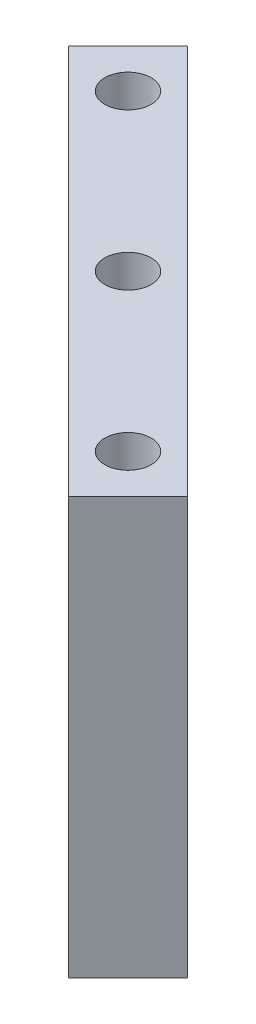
ISO-10303-21;
HEADER;
FILE_DESCRIPTION(('STEP AP214'),'2;1');
FILE_NAME('part.step','',(''),(''),'','','');
FILE_SCHEMA(('AUTOMOTIVE_DESIGN { 1 0 10303 214 1 1 1 1 }'));
ENDSEC;
DATA;
#1=APPLICATION_CONTEXT('core data for automotive mechanical design processes');
#2=APPLICATION_PROTOCOL_DEFINITION('international standard','automotive_design',2000,#1);
#3=PRODUCT_CONTEXT('',#1,'mechanical');
#4=PRODUCT('Part','Part','',(#3));
#5=PRODUCT_RELATED_PRODUCT_CATEGORY('part','',(#4));
#6=PRODUCT_DEFINITION_FORMATION('','',#4);
#7=PRODUCT_DEFINITION_CONTEXT('part definition',#1,'design');
#8=PRODUCT_DEFINITION('design','',#6,#7);
#9=PRODUCT_DEFINITION_SHAPE('','',#8);
#10=(LENGTH_UNIT() NAMED_UNIT(*) SI_UNIT(.MILLI.,.METRE.));
#11=(NAMED_UNIT(*) PLANE_ANGLE_UNIT() SI_UNIT($,.RADIAN.));
#12=(NAMED_UNIT(*) SI_UNIT($,.STERADIAN.) SOLID_ANGLE_UNIT());
#13=UNCERTAINTY_MEASURE_WITH_UNIT(LENGTH_MEASURE(1.E-05),#10,'distance_accuracy_value','');
#14=(GEOMETRIC_REPRESENTATION_CONTEXT(3) GLOBAL_UNCERTAINTY_ASSIGNED_CONTEXT((#13)) GLOBAL_UNIT_ASSIGNED_CONTEXT((#10,
#11,#12)) REPRESENTATION_CONTEXT('',''));
#15=CARTESIAN_POINT('',(0.,0.,0.));
#16=DIRECTION('',(0.,0.,1.));
#17=DIRECTION('',(1.,0.,0.));
#18=AXIS2_PLACEMENT_3D('',#15,#16,#17);
#19=CARTESIAN_POINT('',(0.,37.8,0.));
#20=DIRECTION('',(0.,1.,0.));
#21=DIRECTION('',(0.,0.,1.));
#22=AXIS2_PLACEMENT_3D('',#19,#20,#21);
#23=PLANE('',#22);
#24=CARTESIAN_POINT('',(55.5456351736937,37.8,55.545635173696));
#25=DIRECTION('',(0.,1.,0.));
#26=DIRECTION('',(0.,0.,1.));
#27=AXIS2_PLACEMENT_3D('',#24,#25,#26);
#28=CIRCLE('',#27,2.10000000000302);
#29=CARTESIAN_POINT('',(55.5456351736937,37.8,57.645635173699));
#30=VERTEX_POINT('',#29);
#31=EDGE_CURVE('E123',#30,#30,#28,.T.);
#32=ORIENTED_EDGE('',*,*,#31,.F.);
#33=EDGE_LOOP('',(#32));
#34=FACE_BOUND('',#33,.T.);
#35=DIRECTION('',(0.707106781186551,0.,0.707106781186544));
#36=VECTOR('',#35,1.);
#37=CARTESIAN_POINT('',(35.180959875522,37.8,40.5549714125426));
#38=LINE('',#37,#36);
#39=CARTESIAN_POINT('',(35.180959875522,37.8,40.5549714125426));
#40=VERTEX_POINT('',#39);
#41=CARTESIAN_POINT('',(70.5362989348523,37.8,75.9103104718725));
#42=VERTEX_POINT('',#41);
#43=EDGE_CURVE('E93',#40,#42,#38,.T.);
#44=ORIENTED_EDGE('',*,*,#43,.T.);
#45=DIRECTION('',(0.707106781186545,0.,-0.70710678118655));
#46=VECTOR('',#45,1.);
#47=CARTESIAN_POINT('',(70.5362989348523,37.8,75.9103104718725));
#48=LINE('',#47,#46);
#49=CARTESIAN_POINT('',(75.9103104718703,37.8,70.5362989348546));
#50=VERTEX_POINT('',#49);
#51=EDGE_CURVE('E88',#42,#50,#48,.T.);
#52=ORIENTED_EDGE('',*,*,#51,.T.);
#53=DIRECTION('',(-0.707106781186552,0.,-0.707106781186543));
#54=VECTOR('',#53,1.);
#55=CARTESIAN_POINT('',(40.5549714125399,37.8,35.1809598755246));
#56=LINE('',#55,#54);
#57=CARTESIAN_POINT('',(40.5549714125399,37.8,35.1809598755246));
#58=VERTEX_POINT('',#57);
#59=EDGE_CURVE('E91',#50,#58,#56,.T.);
#60=ORIENTED_EDGE('',*,*,#59,.T.);
#61=DIRECTION('',(-0.707106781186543,0.,0.707106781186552));
#62=VECTOR('',#61,1.);
#63=CARTESIAN_POINT('',(35.180959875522,37.8,40.5549714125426));
#64=LINE('',#63,#62);
#65=EDGE_CURVE('E58',#58,#40,#64,.T.);
#66=ORIENTED_EDGE('',*,*,#65,.T.);
#67=EDGE_LOOP('',(#44,#52,#60,#66));
#68=FACE_BOUND('',#67,.T.);
#69=CARTESIAN_POINT('',(41.4034995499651,37.8,41.4034995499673));
#70=DIRECTION('',(0.,1.,0.));
#71=DIRECTION('',(0.,0.,1.));
#72=AXIS2_PLACEMENT_3D('',#69,#70,#71);
#73=CIRCLE('',#72,2.10000000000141);
#74=CARTESIAN_POINT('',(41.4034995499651,37.8,43.5034995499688));
#75=VERTEX_POINT('',#74);
#76=EDGE_CURVE('E108',#75,#75,#73,.T.);
#77=ORIENTED_EDGE('',*,*,#76,.F.);
#78=EDGE_LOOP('',(#77));
#79=FACE_BOUND('',#78,.T.);
#80=CARTESIAN_POINT('',(69.6877707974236,37.8,69.6877707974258));
#81=DIRECTION('',(0.,1.,0.));
#82=DIRECTION('',(0.,0.,1.));
#83=AXIS2_PLACEMENT_3D('',#80,#81,#82);
#84=CIRCLE('',#83,2.10000000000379);
#85=CARTESIAN_POINT('',(69.6877707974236,37.8,71.7877707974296));
#86=VERTEX_POINT('',#85);
#87=EDGE_CURVE('E129',#86,#86,#84,.T.);
#88=ORIENTED_EDGE('',*,*,#87,.F.);
#89=EDGE_LOOP('',(#88));
#90=FACE_BOUND('',#89,.T.);
#91=ADVANCED_FACE('F41',(#34,#68,#79,#90),#23,.T.);
#92=CARTESIAN_POINT('',(0.,0.,0.));
#93=DIRECTION('',(0.,1.,0.));
#94=DIRECTION('',(0.,0.,1.));
#95=AXIS2_PLACEMENT_3D('',#92,#93,#94);
#96=PLANE('',#95);
#97=DIRECTION('',(0.707106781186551,0.,0.707106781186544));
#98=VECTOR('',#97,1.);
#99=CARTESIAN_POINT('',(35.180959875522,0.,40.5549714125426));
#100=LINE('',#99,#98);
#101=CARTESIAN_POINT('',(35.180959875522,0.,40.5549714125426));
#102=VERTEX_POINT('',#101);
#103=CARTESIAN_POINT('',(70.5362989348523,0.,75.9103104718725));
#104=VERTEX_POINT('',#103);
#105=EDGE_CURVE('E105',#102,#104,#100,.T.);
#106=ORIENTED_EDGE('',*,*,#105,.F.);
#107=DIRECTION('',(-0.707106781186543,0.,0.707106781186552));
#108=VECTOR('',#107,1.);
#109=CARTESIAN_POINT('',(35.180959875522,0.,40.5549714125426));
#110=LINE('',#109,#108);
#111=CARTESIAN_POINT('',(40.5549714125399,0.,35.1809598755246));
#112=VERTEX_POINT('',#111);
#113=EDGE_CURVE('E81',#112,#102,#110,.T.);
#114=ORIENTED_EDGE('',*,*,#113,.F.);
#115=DIRECTION('',(-0.707106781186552,0.,-0.707106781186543));
#116=VECTOR('',#115,1.);
#117=CARTESIAN_POINT('',(40.5549714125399,0.,35.1809598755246));
#118=LINE('',#117,#116);
#119=CARTESIAN_POINT('',(75.9103104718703,0.,70.5362989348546));
#120=VERTEX_POINT('',#119);
#121=EDGE_CURVE('E75',#120,#112,#118,.T.);
#122=ORIENTED_EDGE('',*,*,#121,.F.);
#123=DIRECTION('',(0.707106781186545,0.,-0.70710678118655));
#124=VECTOR('',#123,1.);
#125=CARTESIAN_POINT('',(70.5362989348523,0.,75.9103104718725));
#126=LINE('',#125,#124);
#127=EDGE_CURVE('E97',#104,#120,#126,.T.);
#128=ORIENTED_EDGE('',*,*,#127,.F.);
#129=EDGE_LOOP('',(#106,#114,#122,#128));
#130=FACE_BOUND('',#129,.T.);
#131=CARTESIAN_POINT('',(41.4034995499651,0.,41.4034995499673));
#132=DIRECTION('',(0.,1.,0.));
#133=DIRECTION('',(0.,0.,1.));
#134=AXIS2_PLACEMENT_3D('',#131,#132,#133);
#135=CIRCLE('',#134,2.10000000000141);
#136=CARTESIAN_POINT('',(41.4034995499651,0.,43.5034995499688));
#137=VERTEX_POINT('',#136);
#138=EDGE_CURVE('E120',#137,#137,#135,.T.);
#139=ORIENTED_EDGE('',*,*,#138,.T.);
#140=EDGE_LOOP('',(#139));
#141=FACE_BOUND('',#140,.T.);
#142=CARTESIAN_POINT('',(55.5456351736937,0.,55.545635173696));
#143=DIRECTION('',(0.,1.,0.));
#144=DIRECTION('',(0.,0.,1.));
#145=AXIS2_PLACEMENT_3D('',#142,#143,#144);
#146=CIRCLE('',#145,2.10000000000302);
#147=CARTESIAN_POINT('',(55.5456351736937,0.,57.645635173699));
#148=VERTEX_POINT('',#147);
#149=EDGE_CURVE('E126',#148,#148,#146,.T.);
#150=ORIENTED_EDGE('',*,*,#149,.T.);
#151=EDGE_LOOP('',(#150));
#152=FACE_BOUND('',#151,.T.);
#153=CARTESIAN_POINT('',(69.6877707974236,0.,69.6877707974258));
#154=DIRECTION('',(0.,1.,0.));
#155=DIRECTION('',(0.,0.,1.));
#156=AXIS2_PLACEMENT_3D('',#153,#154,#155);
#157=CIRCLE('',#156,2.10000000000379);
#158=CARTESIAN_POINT('',(69.6877707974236,0.,71.7877707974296));
#159=VERTEX_POINT('',#158);
#160=EDGE_CURVE('E132',#159,#159,#157,.T.);
#161=ORIENTED_EDGE('',*,*,#160,.T.);
#162=EDGE_LOOP('',(#161));
#163=FACE_BOUND('',#162,.T.);
#164=ADVANCED_FACE('F116',(#130,#141,#152,#163),#96,.F.);
#165=CARTESIAN_POINT('',(35.180959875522,37.8,40.5549714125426));
#166=DIRECTION('',(0.707106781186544,0.,-0.707106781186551));
#167=DIRECTION('',(-0.707106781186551,0.,-0.707106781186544));
#168=AXIS2_PLACEMENT_3D('',#165,#166,#167);
#169=PLANE('',#168);
#170=ORIENTED_EDGE('',*,*,#105,.T.);
#171=DIRECTION('',(0.,-1.,0.));
#172=VECTOR('',#171,1.);
#173=CARTESIAN_POINT('',(70.5362989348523,37.8,75.9103104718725));
#174=LINE('',#173,#172);
#175=EDGE_CURVE('E11',#42,#104,#174,.T.);
#176=ORIENTED_EDGE('',*,*,#175,.F.);
#177=ORIENTED_EDGE('',*,*,#43,.F.);
#178=DIRECTION('',(0.,-1.,0.));
#179=VECTOR('',#178,1.);
#180=CARTESIAN_POINT('',(35.180959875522,37.8,40.5549714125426));
#181=LINE('',#180,#179);
#182=EDGE_CURVE('E101',#40,#102,#181,.T.);
#183=ORIENTED_EDGE('',*,*,#182,.T.);
#184=EDGE_LOOP('',(#170,#176,#177,#183));
#185=FACE_BOUND('',#184,.T.);
#186=ADVANCED_FACE('F43',(#185),#169,.F.);
#187=CARTESIAN_POINT('',(70.5362989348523,37.8,75.9103104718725));
#188=DIRECTION('',(-0.70710678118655,0.,-0.707106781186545));
#189=DIRECTION('',(-0.707106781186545,0.,0.70710678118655));
#190=AXIS2_PLACEMENT_3D('',#187,#188,#189);
#191=PLANE('',#190);
#192=ORIENTED_EDGE('',*,*,#127,.T.);
#193=DIRECTION('',(0.,-1.,0.));
#194=VECTOR('',#193,1.);
#195=CARTESIAN_POINT('',(75.9103104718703,37.8,70.5362989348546));
#196=LINE('',#195,#194);
#197=EDGE_CURVE('E50',#50,#120,#196,.T.);
#198=ORIENTED_EDGE('',*,*,#197,.F.);
#199=ORIENTED_EDGE('',*,*,#51,.F.);
#200=ORIENTED_EDGE('',*,*,#175,.T.);
#201=EDGE_LOOP('',(#192,#198,#199,#200));
#202=FACE_BOUND('',#201,.T.);
#203=ADVANCED_FACE('F96',(#202),#191,.F.);
#204=CARTESIAN_POINT('',(40.5549714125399,37.8,35.1809598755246));
#205=DIRECTION('',(-0.707106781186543,0.,0.707106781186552));
#206=DIRECTION('',(0.707106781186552,0.,0.707106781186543));
#207=AXIS2_PLACEMENT_3D('',#204,#205,#206);
#208=PLANE('',#207);
#209=ORIENTED_EDGE('',*,*,#121,.T.);
#210=DIRECTION('',(0.,-1.,0.));
#211=VECTOR('',#210,1.);
#212=CARTESIAN_POINT('',(40.5549714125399,37.8,35.1809598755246));
#213=LINE('',#212,#211);
#214=EDGE_CURVE('E98',#58,#112,#213,.T.);
#215=ORIENTED_EDGE('',*,*,#214,.F.);
#216=ORIENTED_EDGE('',*,*,#59,.F.);
#217=ORIENTED_EDGE('',*,*,#197,.T.);
#218=EDGE_LOOP('',(#209,#215,#216,#217));
#219=FACE_BOUND('',#218,.T.);
#220=ADVANCED_FACE('F99',(#219),#208,.F.);
#221=CARTESIAN_POINT('',(35.180959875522,37.8,40.5549714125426));
#222=DIRECTION('',(0.707106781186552,0.,0.707106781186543));
#223=DIRECTION('',(0.707106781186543,0.,-0.707106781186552));
#224=AXIS2_PLACEMENT_3D('',#221,#222,#223);
#225=PLANE('',#224);
#226=ORIENTED_EDGE('',*,*,#113,.T.);
#227=ORIENTED_EDGE('',*,*,#182,.F.);
#228=ORIENTED_EDGE('',*,*,#65,.F.);
#229=ORIENTED_EDGE('',*,*,#214,.T.);
#230=EDGE_LOOP('',(#226,#227,#228,#229));
#231=FACE_BOUND('',#230,.T.);
#232=ADVANCED_FACE('F113',(#231),#225,.F.);
#233=CARTESIAN_POINT('',(41.4034995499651,37.8,41.4034995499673));
#234=DIRECTION('',(0.,-1.,0.));
#235=DIRECTION('',(0.,0.,-1.));
#236=AXIS2_PLACEMENT_3D('',#233,#234,#235);
#237=CYLINDRICAL_SURFACE('',#236,2.10000000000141);
#238=ORIENTED_EDGE('',*,*,#76,.T.);
#239=EDGE_LOOP('',(#238));
#240=FACE_BOUND('',#239,.T.);
#241=ORIENTED_EDGE('',*,*,#138,.F.);
#242=EDGE_LOOP('',(#241));
#243=FACE_BOUND('',#242,.T.);
#244=ADVANCED_FACE('F150',(#240,#243),#237,.F.);
#245=CARTESIAN_POINT('',(55.5456351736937,37.8,55.545635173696));
#246=DIRECTION('',(0.,-1.,0.));
#247=DIRECTION('',(0.,0.,-1.));
#248=AXIS2_PLACEMENT_3D('',#245,#246,#247);
#249=CYLINDRICAL_SURFACE('',#248,2.10000000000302);
#250=ORIENTED_EDGE('',*,*,#31,.T.);
#251=EDGE_LOOP('',(#250));
#252=FACE_BOUND('',#251,.T.);
#253=ORIENTED_EDGE('',*,*,#149,.F.);
#254=EDGE_LOOP('',(#253));
#255=FACE_BOUND('',#254,.T.);
#256=ADVANCED_FACE('F195',(#252,#255),#249,.F.);
#257=CARTESIAN_POINT('',(69.6877707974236,37.8,69.6877707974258));
#258=DIRECTION('',(0.,-1.,0.));
#259=DIRECTION('',(0.,0.,-1.));
#260=AXIS2_PLACEMENT_3D('',#257,#258,#259);
#261=CYLINDRICAL_SURFACE('',#260,2.10000000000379);
#262=ORIENTED_EDGE('',*,*,#87,.T.);
#263=EDGE_LOOP('',(#262));
#264=FACE_BOUND('',#263,.T.);
#265=ORIENTED_EDGE('',*,*,#160,.F.);
#266=EDGE_LOOP('',(#265));
#267=FACE_BOUND('',#266,.T.);
#268=ADVANCED_FACE('F138',(#264,#267),#261,.F.);
#269=CLOSED_SHELL('',(#91,#164,#186,#203,#220,#232,#244,#256,#268));
#270=MANIFOLD_SOLID_BREP('B2',#269);
#271=ADVANCED_BREP_SHAPE_REPRESENTATION('',(#18,#270),#14);
#272=SHAPE_DEFINITION_REPRESENTATION(#9,#271);
ENDSEC;
END-ISO-10303-21;
